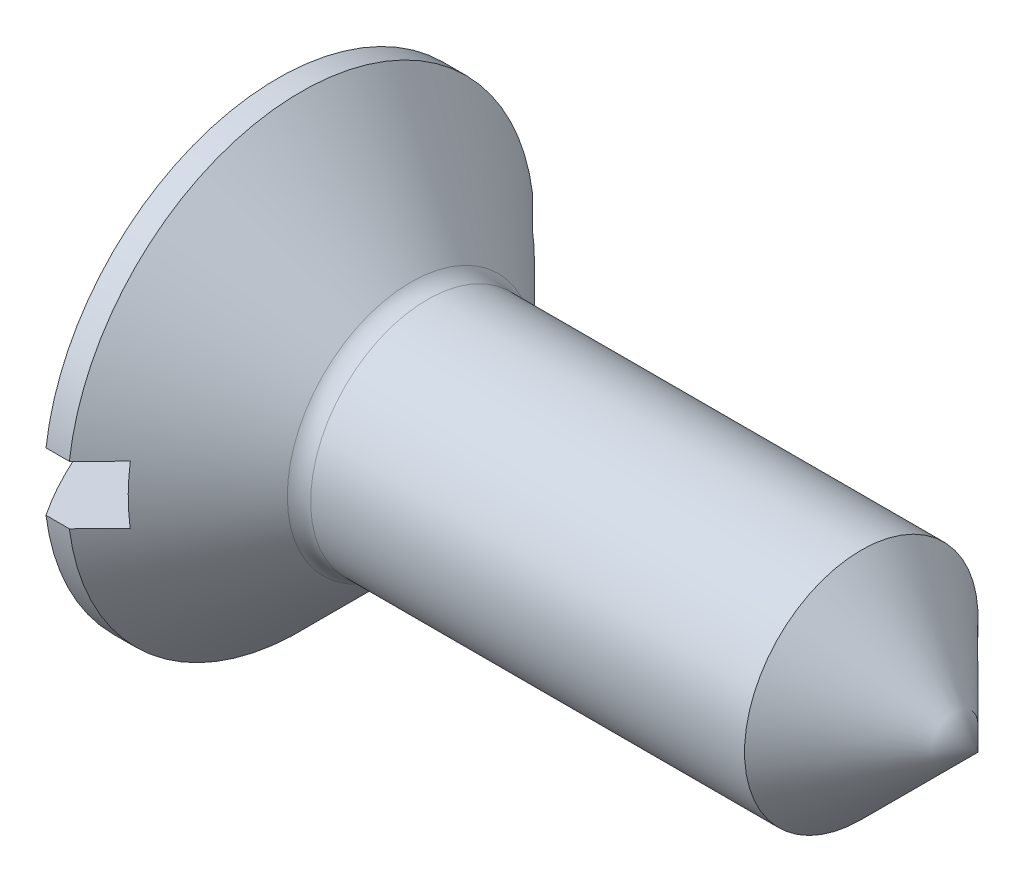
ISO-10303-21;
HEADER;
FILE_DESCRIPTION(('STEP AP214'),'2;1');
FILE_NAME('part.step','',(''),(''),'','','');
FILE_SCHEMA(('AUTOMOTIVE_DESIGN { 1 0 10303 214 1 1 1 1 }'));
ENDSEC;
DATA;
#1=APPLICATION_CONTEXT('core data for automotive mechanical design processes');
#2=APPLICATION_PROTOCOL_DEFINITION('international standard','automotive_design',2000,#1);
#3=PRODUCT_CONTEXT('',#1,'mechanical');
#4=PRODUCT('Part','Part','',(#3));
#5=PRODUCT_RELATED_PRODUCT_CATEGORY('part','',(#4));
#6=PRODUCT_DEFINITION_FORMATION('','',#4);
#7=PRODUCT_DEFINITION_CONTEXT('part definition',#1,'design');
#8=PRODUCT_DEFINITION('design','',#6,#7);
#9=PRODUCT_DEFINITION_SHAPE('','',#8);
#10=(LENGTH_UNIT() NAMED_UNIT(*) SI_UNIT(.MILLI.,.METRE.));
#11=(NAMED_UNIT(*) PLANE_ANGLE_UNIT() SI_UNIT($,.RADIAN.));
#12=(NAMED_UNIT(*) SI_UNIT($,.STERADIAN.) SOLID_ANGLE_UNIT());
#13=UNCERTAINTY_MEASURE_WITH_UNIT(LENGTH_MEASURE(1.E-05),#10,'distance_accuracy_value','');
#14=(GEOMETRIC_REPRESENTATION_CONTEXT(3) GLOBAL_UNCERTAINTY_ASSIGNED_CONTEXT((#13)) GLOBAL_UNIT_ASSIGNED_CONTEXT((#10,
#11,#12)) REPRESENTATION_CONTEXT('',''));
#15=CARTESIAN_POINT('',(0.,0.,0.));
#16=DIRECTION('',(0.,0.,1.));
#17=DIRECTION('',(1.,0.,0.));
#18=AXIS2_PLACEMENT_3D('',#15,#16,#17);
#19=CARTESIAN_POINT('',(5.99999999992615,0.,0.));
#20=DIRECTION('',(-1.,0.,0.));
#21=DIRECTION('',(0.,0.,1.));
#22=AXIS2_PLACEMENT_3D('',#19,#20,#21);
#23=CYLINDRICAL_SURFACE('',#22,1.);
#24=CARTESIAN_POINT('',(1.28284271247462,0.,0.));
#25=DIRECTION('',(1.,0.,0.));
#26=DIRECTION('',(0.,0.,-1.));
#27=AXIS2_PLACEMENT_3D('',#24,#25,#26);
#28=CIRCLE('',#27,1.);
#29=CARTESIAN_POINT('',(1.28284271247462,0.,-1.));
#30=VERTEX_POINT('',#29);
#31=EDGE_CURVE('E46',#30,#30,#28,.T.);
#32=ORIENTED_EDGE('',*,*,#31,.T.);
#33=EDGE_LOOP('',(#32));
#34=FACE_BOUND('',#33,.T.);
#35=CARTESIAN_POINT('',(4.99999999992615,0.,0.));
#36=DIRECTION('',(-1.,0.,0.));
#37=DIRECTION('',(0.,-1.,0.));
#38=AXIS2_PLACEMENT_3D('',#35,#36,#37);
#39=CIRCLE('',#38,1.);
#40=CARTESIAN_POINT('',(4.99999999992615,-1.,0.));
#41=VERTEX_POINT('',#40);
#42=EDGE_CURVE('E41',#41,#41,#39,.F.);
#43=ORIENTED_EDGE('',*,*,#42,.F.);
#44=EDGE_LOOP('',(#43));
#45=FACE_BOUND('',#44,.T.);
#46=ADVANCED_FACE('F37',(#34,#45),#23,.T.);
#47=CARTESIAN_POINT('',(5.99999999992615,0.,0.));
#48=DIRECTION('',(-1.,0.,0.));
#49=DIRECTION('',(0.,0.,1.));
#50=AXIS2_PLACEMENT_3D('',#47,#48,#49);
#51=CYLINDRICAL_SURFACE('',#50,2.);
#52=CARTESIAN_POINT('',(0.200000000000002,0.,0.));
#53=DIRECTION('',(-1.,0.,0.));
#54=DIRECTION('',(0.,0.,1.));
#55=AXIS2_PLACEMENT_3D('',#52,#53,#54);
#56=CIRCLE('',#55,2.);
#57=CARTESIAN_POINT('',(0.200000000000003,-0.250000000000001,-1.98431348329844));
#58=VERTEX_POINT('',#57);
#59=CARTESIAN_POINT('',(0.200000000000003,-0.250000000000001,1.98431348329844));
#60=VERTEX_POINT('',#59);
#61=EDGE_CURVE('E176',#58,#60,#56,.T.);
#62=ORIENTED_EDGE('',*,*,#61,.T.);
#63=DIRECTION('',(-1.,0.,0.));
#64=VECTOR('',#63,1.);
#65=CARTESIAN_POINT('',(5.99999999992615,-0.250000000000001,1.98431348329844));
#66=LINE('',#65,#64);
#67=CARTESIAN_POINT('',(0.,-0.25,1.98431348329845));
#68=VERTEX_POINT('',#67);
#69=EDGE_CURVE('E116',#60,#68,#66,.T.);
#70=ORIENTED_EDGE('',*,*,#69,.T.);
#71=CARTESIAN_POINT('',(0.,0.,0.));
#72=DIRECTION('',(1.,0.,0.));
#73=DIRECTION('',(0.,0.,-1.));
#74=AXIS2_PLACEMENT_3D('',#71,#72,#73);
#75=CIRCLE('',#74,2.);
#76=CARTESIAN_POINT('',(0.,-0.25,-1.98431348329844));
#77=VERTEX_POINT('',#76);
#78=EDGE_CURVE('E169',#68,#77,#75,.T.);
#79=ORIENTED_EDGE('',*,*,#78,.T.);
#80=DIRECTION('',(-1.,0.,0.));
#81=VECTOR('',#80,1.);
#82=CARTESIAN_POINT('',(5.99999999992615,-0.250000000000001,-1.98431348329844));
#83=LINE('',#82,#81);
#84=EDGE_CURVE('E107',#77,#58,#83,.F.);
#85=ORIENTED_EDGE('',*,*,#84,.T.);
#86=EDGE_LOOP('',(#62,#70,#79,#85));
#87=FACE_BOUND('',#86,.T.);
#88=ADVANCED_FACE('F211',(#87),#51,.T.);
#89=CARTESIAN_POINT('',(2.9910729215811,0.,0.));
#90=DIRECTION('',(1.,0.,0.));
#91=DIRECTION('',(0.,0.,-1.));
#92=AXIS2_PLACEMENT_3D('',#89,#90,#91);
#93=DEGENERATE_TOROIDAL_SURFACE('',#92,0.00336785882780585,3.6,.F.);
#94=CARTESIAN_POINT('',(-0.600000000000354,0.25,0.));
#95=CARTESIAN_POINT('',(-0.60000171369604,0.25,-0.0835139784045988));
#96=CARTESIAN_POINT('',(-0.597046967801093,0.25,-0.1669986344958));
#97=CARTESIAN_POINT('',(-0.579278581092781,0.25,-0.41879974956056));
#98=CARTESIAN_POINT('',(-0.555429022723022,0.25,-0.586581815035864));
#99=CARTESIAN_POINT('',(-0.484314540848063,0.25,-0.917304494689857));
#100=CARTESIAN_POINT('',(-0.437012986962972,0.25,-1.08023711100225));
#101=CARTESIAN_POINT('',(-0.319957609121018,0.25,-1.39770760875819));
#102=CARTESIAN_POINT('',(-0.250221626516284,0.25,-1.55225204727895));
#103=CARTESIAN_POINT('',(-0.0897069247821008,0.25,-1.84995386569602));
#104=CARTESIAN_POINT('',(0.00107093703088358,0.25,-1.99311170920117));
#105=CARTESIAN_POINT('',(0.221364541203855,0.25,-2.29158568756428));
#106=CARTESIAN_POINT('',(0.354976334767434,0.25,-2.44390384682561));
#107=CARTESIAN_POINT('',(0.645926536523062,0.25,-2.7239998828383));
#108=CARTESIAN_POINT('',(0.803277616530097,0.25,-2.85176456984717));
#109=CARTESIAN_POINT('',(1.13717566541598,0.25,-3.0790444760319));
#110=CARTESIAN_POINT('',(1.31371920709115,0.25,-3.17856472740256));
#111=CARTESIAN_POINT('',(1.68098807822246,0.25,-3.34654103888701));
#112=CARTESIAN_POINT('',(1.87171190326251,0.25,-3.41500038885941));
#113=CARTESIAN_POINT('',(2.26195625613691,0.250000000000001,-3.5189330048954));
#114=CARTESIAN_POINT('',(2.46147724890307,0.250000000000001,-3.55440452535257));
#115=CARTESIAN_POINT('',(2.86364520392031,0.250000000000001,-3.59134777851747));
#116=CARTESIAN_POINT('',(3.06629221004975,0.250000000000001,-3.59281903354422));
#117=CARTESIAN_POINT('',(3.46895540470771,0.250000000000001,-3.56171911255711));
#118=CARTESIAN_POINT('',(3.66897161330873,0.250000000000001,-3.52914819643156));
#119=CARTESIAN_POINT('',(4.06069778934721,0.250000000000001,-3.43088863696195));
#120=CARTESIAN_POINT('',(4.25240772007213,0.250000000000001,-3.36519984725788));
#121=CARTESIAN_POINT('',(4.62207918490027,0.250000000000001,-3.2025687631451));
#122=CARTESIAN_POINT('',(4.8000406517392,0.250000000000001,-3.10562631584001));
#123=CARTESIAN_POINT('',(5.13715973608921,0.250000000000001,-2.88324159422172));
#124=CARTESIAN_POINT('',(5.29631763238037,0.250000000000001,-2.75779974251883));
#125=CARTESIAN_POINT('',(5.59131262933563,0.250000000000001,-2.48197785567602));
#126=CARTESIAN_POINT('',(5.72715002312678,0.250000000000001,-2.33159813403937));
#127=CARTESIAN_POINT('',(5.9716548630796,0.250000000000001,-2.01016276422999));
#128=CARTESIAN_POINT('',(6.08032137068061,0.250000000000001,-1.83910640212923));
#129=CARTESIAN_POINT('',(6.26739113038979,0.250000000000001,-1.48117708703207));
#130=CARTESIAN_POINT('',(6.34579453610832,0.250000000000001,-1.29430421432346));
#131=CARTESIAN_POINT('',(6.47011192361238,0.250000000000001,-0.910059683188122));
#132=CARTESIAN_POINT('',(6.51602737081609,0.250000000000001,-0.712688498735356));
#133=CARTESIAN_POINT('',(6.57403700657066,0.250000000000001,-0.313019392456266));
#134=CARTESIAN_POINT('',(6.58613111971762,0.250000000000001,-0.110721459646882));
#135=CARTESIAN_POINT('',(6.57581716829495,0.250000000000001,0.292990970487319));
#136=CARTESIAN_POINT('',(6.55340897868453,0.250000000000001,0.494405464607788));
#137=CARTESIAN_POINT('',(6.47535216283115,0.250000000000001,0.889554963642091));
#138=CARTESIAN_POINT('',(6.41988069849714,0.250000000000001,1.08332507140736));
#139=CARTESIAN_POINT('',(6.2773401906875,0.250000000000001,1.45888232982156));
#140=CARTESIAN_POINT('',(6.19027067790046,0.250000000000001,1.64066930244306));
#141=CARTESIAN_POINT('',(5.98646763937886,0.250000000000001,1.98805412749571));
#142=CARTESIAN_POINT('',(5.86958206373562,0.250000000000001,2.15356278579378));
#143=CARTESIAN_POINT('',(5.60968631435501,0.250000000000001,2.46260968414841));
#144=CARTESIAN_POINT('',(5.46667616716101,0.250000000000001,2.6061479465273));
#145=CARTESIAN_POINT('',(5.1585701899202,0.250000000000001,2.86719941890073));
#146=CARTESIAN_POINT('',(4.99347143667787,0.250000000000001,2.98470917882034));
#147=CARTESIAN_POINT('',(4.64588840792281,0.250000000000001,3.19034396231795));
#148=CARTESIAN_POINT('',(4.46340404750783,0.250000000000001,3.27846884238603));
#149=CARTESIAN_POINT('',(4.08622872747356,0.250000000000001,3.42283240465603));
#150=CARTESIAN_POINT('',(3.89153764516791,0.250000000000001,3.47907076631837));
#151=CARTESIAN_POINT('',(3.49547757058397,0.250000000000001,3.55806340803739));
#152=CARTESIAN_POINT('',(3.29410858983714,0.250000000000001,3.58081774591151));
#153=CARTESIAN_POINT('',(2.8904080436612,0.250000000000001,3.5921966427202));
#154=CARTESIAN_POINT('',(2.68807647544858,0.250000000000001,3.58082110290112));
#155=CARTESIAN_POINT('',(2.28819470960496,0.250000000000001,3.52426288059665));
#156=CARTESIAN_POINT('',(2.09064451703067,0.250000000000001,3.47908016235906));
#157=CARTESIAN_POINT('',(1.70593262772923,0.25,3.35618992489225));
#158=CARTESIAN_POINT('',(1.51877098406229,0.25,3.27848223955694));
#159=CARTESIAN_POINT('',(1.16015223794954,0.25,3.09274852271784));
#160=CARTESIAN_POINT('',(0.988694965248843,0.25,2.98472281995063));
#161=CARTESIAN_POINT('',(0.666355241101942,0.25,2.74142466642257));
#162=CARTESIAN_POINT('',(0.515472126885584,0.25,2.60615309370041));
#163=CARTESIAN_POINT('',(0.238546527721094,0.25,2.31218424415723));
#164=CARTESIAN_POINT('',(0.112505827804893,0.25,2.15348528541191));
#165=CARTESIAN_POINT('',(-0.111155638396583,0.25,1.81717273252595));
#166=CARTESIAN_POINT('',(-0.208772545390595,0.25,1.63955657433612));
#167=CARTESIAN_POINT('',(-0.37276990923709,0.25,1.27045615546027));
#168=CARTESIAN_POINT('',(-0.439161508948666,0.25,1.07897687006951));
#169=CARTESIAN_POINT('',(-0.525778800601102,0.25,0.739073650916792));
#170=CARTESIAN_POINT('',(-0.553542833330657,0.25,0.592514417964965));
#171=CARTESIAN_POINT('',(-0.59063503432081,0.25,0.29726958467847));
#172=CARTESIAN_POINT('',(-0.599996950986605,0.25,0.148588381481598));
#173=CARTESIAN_POINT('',(-0.600000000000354,0.25,0.));
#174=B_SPLINE_CURVE_WITH_KNOTS('',3,(#94,#95,#96,#97,#98,#99,#100,#101,#102,#103,#104,#105,#106,
#107,#108,#109,#110,#111,#112,#113,#114,#115,#116,#117,#118,#119,#120,#121,#122,#123,#124,#125,
#126,#127,#128,#129,#130,#131,#132,#133,#134,#135,#136,#137,#138,#139,#140,#141,#142,#143,#144,
#145,#146,#147,#148,#149,#150,#151,#152,#153,#154,#155,#156,#157,#158,#159,#160,#161,#162,#163,
#164,#165,#166,#167,#168,#169,#170,#171,#172,#173),.UNSPECIFIED.,.T.,.F.,(4,2,2,2,2,2,2,2,2,2,2,
2,2,2,2,2,2,2,2,2,2,2,2,2,2,2,2,2,2,2,2,2,2,2,2,2,2,2,2,4),(0.,0.25046611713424,
0.757008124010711,1.26434381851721,1.77127703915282,2.27818960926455,2.88307777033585,
3.48828996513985,4.09339426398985,4.69843445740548,5.30350666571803,5.90858737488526,
6.5136634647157,7.11874222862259,7.72382395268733,8.32889670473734,8.93396185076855,
9.5390478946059,10.1441308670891,10.7491865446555,11.3542435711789,11.9593027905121,
12.5611487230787,13.1630035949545,13.7679912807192,14.3729783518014,14.9780455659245,
15.5831157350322,16.1881919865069,16.7932671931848,17.3983441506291,18.003421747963,
18.6085024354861,19.2135765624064,19.8186311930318,20.4237292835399,21.0289094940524,
21.6338735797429,22.080323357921,22.5259536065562),.UNSPECIFIED.);
#175=CARTESIAN_POINT('',(0.,0.25,1.98431348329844));
#176=VERTEX_POINT('',#175);
#177=CARTESIAN_POINT('',(0.,0.25,-1.98431348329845));
#178=VERTEX_POINT('',#177);
#179=EDGE_CURVE('E153',#176,#178,#174,.T.);
#180=ORIENTED_EDGE('',*,*,#179,.F.);
#181=EDGE_CURVE('E172',#178,#176,#75,.T.);
#182=ORIENTED_EDGE('',*,*,#181,.F.);
#183=EDGE_LOOP('',(#180,#182));
#184=FACE_BOUND('',#183,.T.);
#185=ADVANCED_FACE('F142',(#184),#93,.F.);
#186=CARTESIAN_POINT('',(1.2,0.,0.));
#187=DIRECTION('',(-1.,0.,0.));
#188=DIRECTION('',(0.,0.,1.));
#189=AXIS2_PLACEMENT_3D('',#186,#187,#188);
#190=CONICAL_SURFACE('',#189,1.,0.78539816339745);
#191=CARTESIAN_POINT('',(1.14142135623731,0.,0.));
#192=DIRECTION('',(1.,0.,0.));
#193=DIRECTION('',(0.,0.,-1.));
#194=AXIS2_PLACEMENT_3D('',#191,#192,#193);
#195=CIRCLE('',#194,1.05857864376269);
#196=CARTESIAN_POINT('',(1.14142135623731,0.,-1.05857864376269));
#197=VERTEX_POINT('',#196);
#198=EDGE_CURVE('E11',#197,#197,#195,.F.);
#199=ORIENTED_EDGE('',*,*,#198,.T.);
#200=EDGE_LOOP('',(#199));
#201=FACE_BOUND('',#200,.T.);
#202=CARTESIAN_POINT('',(-2.20526465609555,0.25,-4.39816515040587));
#203=CARTESIAN_POINT('',(-2.05588275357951,0.25,-4.24854021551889));
#204=CARTESIAN_POINT('',(-1.90651135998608,0.25,-4.0989047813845));
#205=CARTESIAN_POINT('',(-1.60780129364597,0.25,-3.79959791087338));
#206=CARTESIAN_POINT('',(-1.45846262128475,0.25,-3.64992647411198));
#207=CARTESIAN_POINT('',(-1.15979531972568,0.25,-3.35049812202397));
#208=CARTESIAN_POINT('',(-1.0104667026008,0.25,-3.20074119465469));
#209=CARTESIAN_POINT('',(-0.711882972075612,0.25,-2.90115732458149));
#210=CARTESIAN_POINT('',(-0.562627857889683,0.25,-2.75133038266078));
#211=CARTESIAN_POINT('',(-0.259171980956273,0.25,-2.44647624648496));
#212=CARTESIAN_POINT('',(-0.104975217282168,0.25,-2.29144507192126));
#213=CARTESIAN_POINT('',(0.203208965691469,0.25,-1.9811645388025));
#214=CARTESIAN_POINT('',(0.357196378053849,0.25,-1.82591517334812));
#215=CARTESIAN_POINT('',(0.587822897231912,0.25,-1.59271539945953));
#216=CARTESIAN_POINT('',(0.664633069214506,0.25,-1.51493419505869));
#217=CARTESIAN_POINT('',(0.818073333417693,0.25,-1.35919209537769));
#218=CARTESIAN_POINT('',(0.894703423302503,0.25,-1.28123119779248));
#219=CARTESIAN_POINT('',(1.04765221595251,0.25,-1.12501396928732));
#220=CARTESIAN_POINT('',(1.12397093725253,0.25,-1.04675765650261));
#221=CARTESIAN_POINT('',(1.27605378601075,0.25,-0.889708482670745));
#222=CARTESIAN_POINT('',(1.35181792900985,0.25,-0.81091563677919));
#223=CARTESIAN_POINT('',(1.44715667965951,0.25,-0.710153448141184));
#224=CARTESIAN_POINT('',(1.46732397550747,0.25,-0.688746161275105));
#225=CARTESIAN_POINT('',(1.50752968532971,0.25,-0.645810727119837));
#226=CARTESIAN_POINT('',(1.52756809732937,0.25,-0.624282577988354));
#227=CARTESIAN_POINT('',(1.58730758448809,0.25,-0.55961798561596));
#228=CARTESIAN_POINT('',(1.62676988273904,0.25,-0.516257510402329));
#229=CARTESIAN_POINT('',(1.69158194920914,0.25,-0.442915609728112));
#230=CARTESIAN_POINT('',(1.7172861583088,0.25,-0.413247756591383));
#231=CARTESIAN_POINT('',(1.76786123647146,0.25,-0.352882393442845));
#232=CARTESIAN_POINT('',(1.79272608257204,0.25,-0.322179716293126));
#233=CARTESIAN_POINT('',(1.82866649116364,0.25,-0.274761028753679));
#234=CARTESIAN_POINT('',(1.84049252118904,0.25,-0.25861833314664));
#235=CARTESIAN_POINT('',(1.86334485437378,0.25,-0.225780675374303));
#236=CARTESIAN_POINT('',(1.87437155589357,0.25,-0.209085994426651));
#237=CARTESIAN_POINT('',(1.89510087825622,0.25,-0.175055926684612));
#238=CARTESIAN_POINT('',(1.90481312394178,0.25,-0.157726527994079));
#239=CARTESIAN_POINT('',(1.92220985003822,0.25,-0.122099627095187));
#240=CARTESIAN_POINT('',(1.92990049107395,0.250000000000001,-0.103805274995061));
#241=CARTESIAN_POINT('',(1.94148779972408,0.250000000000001,-0.0677562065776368));
#242=CARTESIAN_POINT('',(1.94565854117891,0.250000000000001,-0.0500954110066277));
#243=CARTESIAN_POINT('',(1.95020412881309,0.250000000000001,-0.0143600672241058));
#244=CARTESIAN_POINT('',(1.9506024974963,0.250000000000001,0.00371121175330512));
#245=CARTESIAN_POINT('',(1.94753973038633,0.250000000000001,0.0394304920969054));
#246=CARTESIAN_POINT('',(1.94409159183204,0.250000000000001,0.057079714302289));
#247=CARTESIAN_POINT('',(1.93426190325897,0.250000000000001,0.0916318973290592));
#248=CARTESIAN_POINT('',(1.92785728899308,0.250000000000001,0.108527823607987));
#249=CARTESIAN_POINT('',(1.9141890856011,0.250000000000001,0.139094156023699));
#250=CARTESIAN_POINT('',(1.90717656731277,0.25,0.152881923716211));
#251=CARTESIAN_POINT('',(1.89218766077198,0.25,0.179929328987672));
#252=CARTESIAN_POINT('',(1.88421052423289,0.25,0.193188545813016));
#253=CARTESIAN_POINT('',(1.85925152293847,0.25,0.232428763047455));
#254=CARTESIAN_POINT('',(1.84128955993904,0.25,0.25777816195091));
#255=CARTESIAN_POINT('',(1.80388647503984,0.25,0.307694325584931));
#256=CARTESIAN_POINT('',(1.78443313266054,0.25,0.33225159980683));
#257=CARTESIAN_POINT('',(1.74478880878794,0.25,0.380668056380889));
#258=CARTESIAN_POINT('',(1.72459960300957,0.25,0.404528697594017));
#259=CARTESIAN_POINT('',(1.66418602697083,0.25,0.474501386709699));
#260=CARTESIAN_POINT('',(1.62329550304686,0.25,0.520033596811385));
#261=CARTESIAN_POINT('',(1.5406832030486,0.25,0.610341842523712));
#262=CARTESIAN_POINT('',(1.49896127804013,0.25,0.65511773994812));
#263=CARTESIAN_POINT('',(1.41499813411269,0.25,0.744280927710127));
#264=CARTESIAN_POINT('',(1.37275635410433,0.25,0.788667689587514));
#265=CARTESIAN_POINT('',(1.28799192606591,0.25,0.877164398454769));
#266=CARTESIAN_POINT('',(1.24546930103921,0.25,0.921274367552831));
#267=CARTESIAN_POINT('',(1.11848668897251,0.25,1.05245331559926));
#268=CARTESIAN_POINT('',(1.03376105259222,0.25,1.1392649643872));
#269=CARTESIAN_POINT('',(0.86400413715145,0.25,1.31250563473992));
#270=CARTESIAN_POINT('',(0.778973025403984,0.25,1.39893482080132));
#271=CARTESIAN_POINT('',(0.574754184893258,0.25,1.60603012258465));
#272=CARTESIAN_POINT('',(0.455470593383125,0.25,1.72660170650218));
#273=CARTESIAN_POINT('',(0.216700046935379,0.25,1.96754389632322));
#274=CARTESIAN_POINT('',(0.0972130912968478,0.25,2.08791450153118));
#275=CARTESIAN_POINT('',(-0.26147589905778,0.25,2.44890132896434));
#276=CARTESIAN_POINT('',(-0.500855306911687,0.25,2.68934128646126));
#277=CARTESIAN_POINT('',(-0.984368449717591,0.25,3.17460431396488));
#278=CARTESIAN_POINT('',(-1.22850591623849,0.25,3.41942366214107));
#279=CARTESIAN_POINT('',(-1.7168446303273,0.25,3.90888955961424));
#280=CARTESIAN_POINT('',(-1.96104585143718,0.25,4.15353613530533));
#281=CARTESIAN_POINT('',(-2.20526465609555,0.25,4.39816515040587));
#282=B_SPLINE_CURVE_WITH_KNOTS('',3,(#202,#203,#204,#205,#206,#207,#208,#209,#210,#211,#212,
#213,#214,#215,#216,#217,#218,#219,#220,#221,#222,#223,#224,#225,#226,#227,#228,#229,#230,#231,
#232,#233,#234,#235,#236,#237,#238,#239,#240,#241,#242,#243,#244,#245,#246,#247,#248,#249,#250,
#251,#252,#253,#254,#255,#256,#257,#258,#259,#260,#261,#262,#263,#264,#265,#266,#267,#268,#269,
#270,#271,#272,#273,#274,#275,#276,#277,#278,#279,#280,#281),.UNSPECIFIED.,.F.,.F.,(4,2,2,2,2,2,
2,2,2,2,2,2,2,2,2,2,2,2,2,2,2,2,2,2,2,2,2,2,2,2,2,2,2,2,2,2,2,2,2,4),(0.,0.634289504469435,
1.26858611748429,1.90304300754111,2.53749296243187,3.19346683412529,3.84946193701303,
4.17740613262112,4.50535455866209,4.83328316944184,5.16120255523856,5.24943414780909,
5.33766708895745,5.51353700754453,5.63129259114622,5.74976475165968,5.80978298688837,
5.86977110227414,5.92929298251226,5.9886313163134,6.04275369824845,6.09653837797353,
6.15014186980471,6.20417079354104,6.25052854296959,6.29692248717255,6.39002498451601,
6.48399478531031,6.5777511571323,6.76131913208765,6.94492029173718,7.12874090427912,
7.31254664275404,7.67645641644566,8.0401904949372,8.54900684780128,9.05782495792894,
10.0756776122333,11.1129126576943,12.1499158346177),.UNSPECIFIED.);
#283=CARTESIAN_POINT('',(0.460000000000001,0.25,1.72194657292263));
#284=VERTEX_POINT('',#283);
#285=CARTESIAN_POINT('',(0.200000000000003,0.250000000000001,1.98431348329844));
#286=VERTEX_POINT('',#285);
#287=EDGE_CURVE('E146',#284,#286,#282,.T.);
#288=ORIENTED_EDGE('',*,*,#287,.F.);
#289=CARTESIAN_POINT('',(0.460000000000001,0.,0.));
#290=DIRECTION('',(1.,0.,0.));
#291=DIRECTION('',(0.,0.,-1.));
#292=AXIS2_PLACEMENT_3D('',#289,#290,#291);
#293=CIRCLE('',#292,1.74);
#294=CARTESIAN_POINT('',(0.460000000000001,-0.25,1.72194657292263));
#295=VERTEX_POINT('',#294);
#296=EDGE_CURVE('E183',#295,#284,#293,.F.);
#297=ORIENTED_EDGE('',*,*,#296,.F.);
#298=CARTESIAN_POINT('',(-2.20526465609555,-0.25,4.39816515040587));
#299=CARTESIAN_POINT('',(-2.05588275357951,-0.25,4.24854021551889));
#300=CARTESIAN_POINT('',(-1.90651135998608,-0.25,4.09890478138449));
#301=CARTESIAN_POINT('',(-1.60780129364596,-0.25,3.79959791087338));
#302=CARTESIAN_POINT('',(-1.45846262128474,-0.25,3.64992647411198));
#303=CARTESIAN_POINT('',(-1.15979531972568,-0.25,3.35049812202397));
#304=CARTESIAN_POINT('',(-1.0104667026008,-0.25,3.20074119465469));
#305=CARTESIAN_POINT('',(-0.711882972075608,-0.25,2.90115732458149));
#306=CARTESIAN_POINT('',(-0.562627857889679,-0.25,2.75133038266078));
#307=CARTESIAN_POINT('',(-0.259171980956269,-0.25,2.44647624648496));
#308=CARTESIAN_POINT('',(-0.104975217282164,-0.25,2.29144507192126));
#309=CARTESIAN_POINT('',(0.203208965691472,-0.25,1.98116453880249));
#310=CARTESIAN_POINT('',(0.357196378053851,-0.25,1.82591517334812));
#311=CARTESIAN_POINT('',(0.587822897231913,-0.25,1.59271539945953));
#312=CARTESIAN_POINT('',(0.664633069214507,-0.25,1.51493419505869));
#313=CARTESIAN_POINT('',(0.818073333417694,-0.25,1.35919209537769));
#314=CARTESIAN_POINT('',(0.894703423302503,-0.25,1.28123119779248));
#315=CARTESIAN_POINT('',(1.04765221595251,-0.25,1.12501396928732));
#316=CARTESIAN_POINT('',(1.12397093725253,-0.25,1.04675765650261));
#317=CARTESIAN_POINT('',(1.27605378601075,-0.25,0.889708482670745));
#318=CARTESIAN_POINT('',(1.35181792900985,-0.25,0.81091563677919));
#319=CARTESIAN_POINT('',(1.44715667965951,-0.25,0.710153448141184));
#320=CARTESIAN_POINT('',(1.46732397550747,-0.25,0.688746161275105));
#321=CARTESIAN_POINT('',(1.50752968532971,-0.25,0.645810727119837));
#322=CARTESIAN_POINT('',(1.52756809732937,-0.25,0.624282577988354));
#323=CARTESIAN_POINT('',(1.58730758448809,-0.25,0.55961798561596));
#324=CARTESIAN_POINT('',(1.62676988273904,-0.25,0.516257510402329));
#325=CARTESIAN_POINT('',(1.69158194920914,-0.25,0.442915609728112));
#326=CARTESIAN_POINT('',(1.7172861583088,-0.25,0.413247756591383));
#327=CARTESIAN_POINT('',(1.76786123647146,-0.25,0.352882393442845));
#328=CARTESIAN_POINT('',(1.79272608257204,-0.25,0.322179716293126));
#329=CARTESIAN_POINT('',(1.82866649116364,-0.25,0.274761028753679));
#330=CARTESIAN_POINT('',(1.84049252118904,-0.25,0.258618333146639));
#331=CARTESIAN_POINT('',(1.86334485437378,-0.25,0.225780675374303));
#332=CARTESIAN_POINT('',(1.87437155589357,-0.25,0.209085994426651));
#333=CARTESIAN_POINT('',(1.89510087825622,-0.25,0.175055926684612));
#334=CARTESIAN_POINT('',(1.90481312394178,-0.25,0.157726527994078));
#335=CARTESIAN_POINT('',(1.92220985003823,-0.25,0.122099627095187));
#336=CARTESIAN_POINT('',(1.92990049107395,-0.250000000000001,0.10380527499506));
#337=CARTESIAN_POINT('',(1.94148779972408,-0.250000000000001,0.0677562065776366));
#338=CARTESIAN_POINT('',(1.94565854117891,-0.250000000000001,0.0500954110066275));
#339=CARTESIAN_POINT('',(1.95020412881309,-0.250000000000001,0.0143600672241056));
#340=CARTESIAN_POINT('',(1.9506024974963,-0.250000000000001,-0.00371121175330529));
#341=CARTESIAN_POINT('',(1.94753973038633,-0.250000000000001,-0.0394304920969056));
#342=CARTESIAN_POINT('',(1.94409159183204,-0.250000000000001,-0.0570797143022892));
#343=CARTESIAN_POINT('',(1.93426190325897,-0.250000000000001,-0.0916318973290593));
#344=CARTESIAN_POINT('',(1.92785728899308,-0.250000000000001,-0.108527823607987));
#345=CARTESIAN_POINT('',(1.9141890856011,-0.250000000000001,-0.139094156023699));
#346=CARTESIAN_POINT('',(1.90717656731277,-0.25,-0.152881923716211));
#347=CARTESIAN_POINT('',(1.89218766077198,-0.25,-0.179929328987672));
#348=CARTESIAN_POINT('',(1.88421052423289,-0.25,-0.193188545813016));
#349=CARTESIAN_POINT('',(1.85925152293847,-0.25,-0.232428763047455));
#350=CARTESIAN_POINT('',(1.84128955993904,-0.25,-0.25777816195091));
#351=CARTESIAN_POINT('',(1.80388647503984,-0.25,-0.307694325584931));
#352=CARTESIAN_POINT('',(1.78443313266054,-0.25,-0.33225159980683));
#353=CARTESIAN_POINT('',(1.74478880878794,-0.25,-0.380668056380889));
#354=CARTESIAN_POINT('',(1.72459960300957,-0.25,-0.404528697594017));
#355=CARTESIAN_POINT('',(1.66418602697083,-0.25,-0.474501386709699));
#356=CARTESIAN_POINT('',(1.62329550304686,-0.25,-0.520033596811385));
#357=CARTESIAN_POINT('',(1.5406832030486,-0.25,-0.610341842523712));
#358=CARTESIAN_POINT('',(1.49896127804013,-0.25,-0.65511773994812));
#359=CARTESIAN_POINT('',(1.41499813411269,-0.25,-0.744280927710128));
#360=CARTESIAN_POINT('',(1.37275635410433,-0.25,-0.788667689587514));
#361=CARTESIAN_POINT('',(1.28799192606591,-0.25,-0.87716439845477));
#362=CARTESIAN_POINT('',(1.24546930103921,-0.25,-0.921274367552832));
#363=CARTESIAN_POINT('',(1.11848668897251,-0.25,-1.05245331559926));
#364=CARTESIAN_POINT('',(1.03376105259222,-0.25,-1.1392649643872));
#365=CARTESIAN_POINT('',(0.86400413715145,-0.25,-1.31250563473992));
#366=CARTESIAN_POINT('',(0.778973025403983,-0.25,-1.39893482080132));
#367=CARTESIAN_POINT('',(0.574754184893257,-0.25,-1.60603012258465));
#368=CARTESIAN_POINT('',(0.455470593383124,-0.25,-1.72660170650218));
#369=CARTESIAN_POINT('',(0.216700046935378,-0.25,-1.96754389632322));
#370=CARTESIAN_POINT('',(0.097213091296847,-0.25,-2.08791450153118));
#371=CARTESIAN_POINT('',(-0.261475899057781,-0.25,-2.44890132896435));
#372=CARTESIAN_POINT('',(-0.500855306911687,-0.25,-2.68934128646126));
#373=CARTESIAN_POINT('',(-0.98436844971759,-0.25,-3.17460431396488));
#374=CARTESIAN_POINT('',(-1.22850591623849,-0.25,-3.41942366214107));
#375=CARTESIAN_POINT('',(-1.7168446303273,-0.25,-3.90888955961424));
#376=CARTESIAN_POINT('',(-1.96104585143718,-0.25,-4.15353613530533));
#377=CARTESIAN_POINT('',(-2.20526465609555,-0.25,-4.39816515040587));
#378=B_SPLINE_CURVE_WITH_KNOTS('',3,(#298,#299,#300,#301,#302,#303,#304,#305,#306,#307,#308,
#309,#310,#311,#312,#313,#314,#315,#316,#317,#318,#319,#320,#321,#322,#323,#324,#325,#326,#327,
#328,#329,#330,#331,#332,#333,#334,#335,#336,#337,#338,#339,#340,#341,#342,#343,#344,#345,#346,
#347,#348,#349,#350,#351,#352,#353,#354,#355,#356,#357,#358,#359,#360,#361,#362,#363,#364,#365,
#366,#367,#368,#369,#370,#371,#372,#373,#374,#375,#376,#377),.UNSPECIFIED.,.F.,.F.,(4,2,2,2,2,2,
2,2,2,2,2,2,2,2,2,2,2,2,2,2,2,2,2,2,2,2,2,2,2,2,2,2,2,2,2,2,2,2,2,4),(0.,0.634289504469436,
1.26858611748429,1.90304300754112,2.53749296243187,3.1934668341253,3.84946193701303,
4.17740613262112,4.50535455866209,4.83328316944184,5.16120255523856,5.24943414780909,
5.33766708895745,5.51353700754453,5.63129259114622,5.74976475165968,5.80978298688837,
5.86977110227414,5.92929298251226,5.9886313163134,6.04275369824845,6.09653837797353,
6.15014186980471,6.20417079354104,6.25052854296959,6.29692248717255,6.39002498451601,
6.48399478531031,6.5777511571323,6.76131913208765,6.94492029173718,7.12874090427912,
7.31254664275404,7.67645641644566,8.0401904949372,8.54900684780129,9.05782495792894,
10.0756776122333,11.1129126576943,12.1499158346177),.UNSPECIFIED.);
#379=EDGE_CURVE('E135',#60,#295,#378,.T.);
#380=ORIENTED_EDGE('',*,*,#379,.F.);
#381=ORIENTED_EDGE('',*,*,#61,.F.);
#382=CARTESIAN_POINT('',(0.460000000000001,-0.25,-1.72194657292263));
#383=VERTEX_POINT('',#382);
#384=EDGE_CURVE('E117',#383,#58,#378,.T.);
#385=ORIENTED_EDGE('',*,*,#384,.F.);
#386=CARTESIAN_POINT('',(0.460000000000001,0.25,-1.72194657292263));
#387=VERTEX_POINT('',#386);
#388=EDGE_CURVE('E181',#387,#383,#293,.F.);
#389=ORIENTED_EDGE('',*,*,#388,.F.);
#390=CARTESIAN_POINT('',(0.200000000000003,0.250000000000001,-1.98431348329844));
#391=VERTEX_POINT('',#390);
#392=EDGE_CURVE('E155',#391,#387,#282,.T.);
#393=ORIENTED_EDGE('',*,*,#392,.F.);
#394=EDGE_CURVE('E180',#286,#391,#56,.T.);
#395=ORIENTED_EDGE('',*,*,#394,.F.);
#396=EDGE_LOOP('',(#288,#297,#380,#381,#385,#389,#393,#395));
#397=FACE_BOUND('',#396,.T.);
#398=ADVANCED_FACE('F137',(#201,#397),#190,.T.);
#399=ORIENTED_EDGE('',*,*,#394,.T.);
#400=DIRECTION('',(-1.,0.,0.));
#401=VECTOR('',#400,1.);
#402=CARTESIAN_POINT('',(5.99999999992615,0.250000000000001,-1.98431348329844));
#403=LINE('',#402,#401);
#404=EDGE_CURVE('E60',#391,#178,#403,.T.);
#405=ORIENTED_EDGE('',*,*,#404,.T.);
#406=ORIENTED_EDGE('',*,*,#181,.T.);
#407=DIRECTION('',(-1.,0.,0.));
#408=VECTOR('',#407,1.);
#409=CARTESIAN_POINT('',(5.99999999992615,0.250000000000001,1.98431348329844));
#410=LINE('',#409,#408);
#411=EDGE_CURVE('E154',#176,#286,#410,.F.);
#412=ORIENTED_EDGE('',*,*,#411,.T.);
#413=EDGE_LOOP('',(#399,#405,#406,#412));
#414=FACE_BOUND('',#413,.T.);
#415=ADVANCED_FACE('F141',(#414),#51,.T.);
#416=CARTESIAN_POINT('',(-0.600000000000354,-0.25,0.));
#417=CARTESIAN_POINT('',(-0.60000171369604,-0.25,0.0835139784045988));
#418=CARTESIAN_POINT('',(-0.597046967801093,-0.25,0.1669986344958));
#419=CARTESIAN_POINT('',(-0.579278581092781,-0.25,0.41879974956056));
#420=CARTESIAN_POINT('',(-0.555429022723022,-0.25,0.586581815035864));
#421=CARTESIAN_POINT('',(-0.484314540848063,-0.25,0.917304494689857));
#422=CARTESIAN_POINT('',(-0.437012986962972,-0.25,1.08023711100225));
#423=CARTESIAN_POINT('',(-0.319957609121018,-0.25,1.39770760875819));
#424=CARTESIAN_POINT('',(-0.250221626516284,-0.25,1.55225204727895));
#425=CARTESIAN_POINT('',(-0.0897069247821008,-0.25,1.84995386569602));
#426=CARTESIAN_POINT('',(0.00107093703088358,-0.25,1.99311170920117));
#427=CARTESIAN_POINT('',(0.221364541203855,-0.25,2.29158568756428));
#428=CARTESIAN_POINT('',(0.354976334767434,-0.25,2.44390384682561));
#429=CARTESIAN_POINT('',(0.645926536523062,-0.25,2.7239998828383));
#430=CARTESIAN_POINT('',(0.803277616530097,-0.25,2.85176456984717));
#431=CARTESIAN_POINT('',(1.13717566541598,-0.25,3.0790444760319));
#432=CARTESIAN_POINT('',(1.31371920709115,-0.25,3.17856472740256));
#433=CARTESIAN_POINT('',(1.68098807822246,-0.25,3.34654103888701));
#434=CARTESIAN_POINT('',(1.87171190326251,-0.25,3.41500038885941));
#435=CARTESIAN_POINT('',(2.26195625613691,-0.250000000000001,3.5189330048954));
#436=CARTESIAN_POINT('',(2.46147724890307,-0.250000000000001,3.55440452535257));
#437=CARTESIAN_POINT('',(2.86364520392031,-0.250000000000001,3.59134777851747));
#438=CARTESIAN_POINT('',(3.06629221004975,-0.250000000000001,3.59281903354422));
#439=CARTESIAN_POINT('',(3.46895540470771,-0.250000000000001,3.56171911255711));
#440=CARTESIAN_POINT('',(3.66897161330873,-0.250000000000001,3.52914819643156));
#441=CARTESIAN_POINT('',(4.06069778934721,-0.250000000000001,3.43088863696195));
#442=CARTESIAN_POINT('',(4.25240772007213,-0.250000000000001,3.36519984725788));
#443=CARTESIAN_POINT('',(4.62207918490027,-0.250000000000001,3.2025687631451));
#444=CARTESIAN_POINT('',(4.8000406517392,-0.250000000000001,3.10562631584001));
#445=CARTESIAN_POINT('',(5.13715973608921,-0.250000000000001,2.88324159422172));
#446=CARTESIAN_POINT('',(5.29631763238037,-0.250000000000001,2.75779974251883));
#447=CARTESIAN_POINT('',(5.59131262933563,-0.250000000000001,2.48197785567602));
#448=CARTESIAN_POINT('',(5.72715002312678,-0.250000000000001,2.33159813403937));
#449=CARTESIAN_POINT('',(5.9716548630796,-0.250000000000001,2.01016276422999));
#450=CARTESIAN_POINT('',(6.08032137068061,-0.250000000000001,1.83910640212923));
#451=CARTESIAN_POINT('',(6.26739113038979,-0.250000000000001,1.48117708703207));
#452=CARTESIAN_POINT('',(6.34579453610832,-0.250000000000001,1.29430421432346));
#453=CARTESIAN_POINT('',(6.47011192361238,-0.250000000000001,0.910059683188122));
#454=CARTESIAN_POINT('',(6.51602737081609,-0.250000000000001,0.712688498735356));
#455=CARTESIAN_POINT('',(6.57403700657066,-0.250000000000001,0.313019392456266));
#456=CARTESIAN_POINT('',(6.58613111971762,-0.250000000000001,0.110721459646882));
#457=CARTESIAN_POINT('',(6.57581716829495,-0.250000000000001,-0.292990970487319));
#458=CARTESIAN_POINT('',(6.55340897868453,-0.250000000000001,-0.494405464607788));
#459=CARTESIAN_POINT('',(6.47535216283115,-0.250000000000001,-0.889554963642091));
#460=CARTESIAN_POINT('',(6.41988069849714,-0.250000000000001,-1.08332507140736));
#461=CARTESIAN_POINT('',(6.2773401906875,-0.250000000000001,-1.45888232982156));
#462=CARTESIAN_POINT('',(6.19027067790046,-0.250000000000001,-1.64066930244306));
#463=CARTESIAN_POINT('',(5.98646763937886,-0.250000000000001,-1.98805412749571));
#464=CARTESIAN_POINT('',(5.86958206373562,-0.250000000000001,-2.15356278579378));
#465=CARTESIAN_POINT('',(5.60968631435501,-0.250000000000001,-2.46260968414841));
#466=CARTESIAN_POINT('',(5.46667616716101,-0.250000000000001,-2.6061479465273));
#467=CARTESIAN_POINT('',(5.1585701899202,-0.250000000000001,-2.86719941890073));
#468=CARTESIAN_POINT('',(4.99347143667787,-0.250000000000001,-2.98470917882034));
#469=CARTESIAN_POINT('',(4.64588840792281,-0.250000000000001,-3.19034396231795));
#470=CARTESIAN_POINT('',(4.46340404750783,-0.250000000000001,-3.27846884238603));
#471=CARTESIAN_POINT('',(4.08622872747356,-0.250000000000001,-3.42283240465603));
#472=CARTESIAN_POINT('',(3.89153764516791,-0.250000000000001,-3.47907076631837));
#473=CARTESIAN_POINT('',(3.49547757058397,-0.250000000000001,-3.55806340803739));
#474=CARTESIAN_POINT('',(3.29410858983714,-0.250000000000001,-3.58081774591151));
#475=CARTESIAN_POINT('',(2.8904080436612,-0.250000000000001,-3.5921966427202));
#476=CARTESIAN_POINT('',(2.68807647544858,-0.250000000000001,-3.58082110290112));
#477=CARTESIAN_POINT('',(2.28819470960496,-0.250000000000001,-3.52426288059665));
#478=CARTESIAN_POINT('',(2.09064451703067,-0.250000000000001,-3.47908016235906));
#479=CARTESIAN_POINT('',(1.70593262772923,-0.25,-3.35618992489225));
#480=CARTESIAN_POINT('',(1.51877098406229,-0.25,-3.27848223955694));
#481=CARTESIAN_POINT('',(1.16015223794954,-0.25,-3.09274852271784));
#482=CARTESIAN_POINT('',(0.988694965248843,-0.25,-2.98472281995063));
#483=CARTESIAN_POINT('',(0.666355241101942,-0.25,-2.74142466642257));
#484=CARTESIAN_POINT('',(0.515472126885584,-0.25,-2.60615309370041));
#485=CARTESIAN_POINT('',(0.238546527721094,-0.25,-2.31218424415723));
#486=CARTESIAN_POINT('',(0.112505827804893,-0.25,-2.15348528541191));
#487=CARTESIAN_POINT('',(-0.111155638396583,-0.25,-1.81717273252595));
#488=CARTESIAN_POINT('',(-0.208772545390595,-0.25,-1.63955657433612));
#489=CARTESIAN_POINT('',(-0.37276990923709,-0.25,-1.27045615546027));
#490=CARTESIAN_POINT('',(-0.439161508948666,-0.25,-1.07897687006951));
#491=CARTESIAN_POINT('',(-0.525778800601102,-0.25,-0.739073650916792));
#492=CARTESIAN_POINT('',(-0.553542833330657,-0.25,-0.592514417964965));
#493=CARTESIAN_POINT('',(-0.59063503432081,-0.25,-0.29726958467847));
#494=CARTESIAN_POINT('',(-0.599996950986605,-0.25,-0.148588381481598));
#495=CARTESIAN_POINT('',(-0.600000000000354,-0.25,0.));
#496=B_SPLINE_CURVE_WITH_KNOTS('',3,(#416,#417,#418,#419,#420,#421,#422,#423,#424,#425,#426,
#427,#428,#429,#430,#431,#432,#433,#434,#435,#436,#437,#438,#439,#440,#441,#442,#443,#444,#445,
#446,#447,#448,#449,#450,#451,#452,#453,#454,#455,#456,#457,#458,#459,#460,#461,#462,#463,#464,
#465,#466,#467,#468,#469,#470,#471,#472,#473,#474,#475,#476,#477,#478,#479,#480,#481,#482,#483,
#484,#485,#486,#487,#488,#489,#490,#491,#492,#493,#494,#495),.UNSPECIFIED.,.T.,.F.,(4,2,2,2,2,2,
2,2,2,2,2,2,2,2,2,2,2,2,2,2,2,2,2,2,2,2,2,2,2,2,2,2,2,2,2,2,2,2,2,4),(0.,0.25046611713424,
0.757008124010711,1.26434381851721,1.77127703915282,2.27818960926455,2.88307777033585,
3.48828996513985,4.09339426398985,4.69843445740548,5.30350666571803,5.90858737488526,
6.5136634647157,7.11874222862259,7.72382395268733,8.32889670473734,8.93396185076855,
9.5390478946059,10.1441308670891,10.7491865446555,11.3542435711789,11.9593027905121,
12.5611487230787,13.1630035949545,13.7679912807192,14.3729783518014,14.9780455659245,
15.5831157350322,16.1881919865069,16.7932671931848,17.3983441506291,18.003421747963,
18.6085024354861,19.2135765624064,19.8186311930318,20.4237292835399,21.0289094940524,
21.6338735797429,22.080323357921,22.5259536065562),.UNSPECIFIED.);
#497=EDGE_CURVE('E52',#77,#68,#496,.T.);
#498=ORIENTED_EDGE('',*,*,#497,.F.);
#499=ORIENTED_EDGE('',*,*,#78,.F.);
#500=EDGE_LOOP('',(#498,#499));
#501=FACE_BOUND('',#500,.T.);
#502=ADVANCED_FACE('F119',(#501),#93,.F.);
#503=CARTESIAN_POINT('',(0.460000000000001,0.25,-2.));
#504=DIRECTION('',(0.,1.,0.));
#505=DIRECTION('',(-1.,0.,0.));
#506=AXIS2_PLACEMENT_3D('',#503,#504,#505);
#507=PLANE('',#506);
#508=ORIENTED_EDGE('',*,*,#392,.T.);
#509=DIRECTION('',(0.,0.,1.));
#510=VECTOR('',#509,1.);
#511=CARTESIAN_POINT('',(0.460000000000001,0.25,-2.));
#512=LINE('',#511,#510);
#513=EDGE_CURVE('E101',#387,#284,#512,.T.);
#514=ORIENTED_EDGE('',*,*,#513,.T.);
#515=ORIENTED_EDGE('',*,*,#287,.T.);
#516=ORIENTED_EDGE('',*,*,#411,.F.);
#517=ORIENTED_EDGE('',*,*,#179,.T.);
#518=ORIENTED_EDGE('',*,*,#404,.F.);
#519=EDGE_LOOP('',(#508,#514,#515,#516,#517,#518));
#520=FACE_BOUND('',#519,.T.);
#521=ADVANCED_FACE('F157',(#520),#507,.F.);
#522=CARTESIAN_POINT('',(0.460000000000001,0.25,-2.));
#523=DIRECTION('',(1.,0.,0.));
#524=DIRECTION('',(0.,0.,-1.));
#525=AXIS2_PLACEMENT_3D('',#522,#523,#524);
#526=PLANE('',#525);
#527=ORIENTED_EDGE('',*,*,#296,.T.);
#528=ORIENTED_EDGE('',*,*,#513,.F.);
#529=ORIENTED_EDGE('',*,*,#388,.T.);
#530=DIRECTION('',(0.,0.,1.));
#531=VECTOR('',#530,1.);
#532=CARTESIAN_POINT('',(0.460000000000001,-0.25,-2.));
#533=LINE('',#532,#531);
#534=EDGE_CURVE('E99',#383,#295,#533,.T.);
#535=ORIENTED_EDGE('',*,*,#534,.T.);
#536=EDGE_LOOP('',(#527,#528,#529,#535));
#537=FACE_BOUND('',#536,.T.);
#538=ADVANCED_FACE('F126',(#537),#526,.F.);
#539=CARTESIAN_POINT('',(-0.599999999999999,-0.25,-2.));
#540=DIRECTION('',(0.,-1.,0.));
#541=DIRECTION('',(1.,0.,0.));
#542=AXIS2_PLACEMENT_3D('',#539,#540,#541);
#543=PLANE('',#542);
#544=ORIENTED_EDGE('',*,*,#379,.T.);
#545=ORIENTED_EDGE('',*,*,#534,.F.);
#546=ORIENTED_EDGE('',*,*,#384,.T.);
#547=ORIENTED_EDGE('',*,*,#84,.F.);
#548=ORIENTED_EDGE('',*,*,#497,.T.);
#549=ORIENTED_EDGE('',*,*,#69,.F.);
#550=EDGE_LOOP('',(#544,#545,#546,#547,#548,#549));
#551=FACE_BOUND('',#550,.T.);
#552=ADVANCED_FACE('F122',(#551),#543,.F.);
#553=CARTESIAN_POINT('',(1.28284271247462,0.,0.));
#554=DIRECTION('',(1.,0.,0.));
#555=DIRECTION('',(0.,0.,-1.));
#556=AXIS2_PLACEMENT_3D('',#553,#554,#555);
#557=TOROIDAL_SURFACE('',#556,1.2,0.2);
#558=ORIENTED_EDGE('',*,*,#198,.F.);
#559=EDGE_LOOP('',(#558));
#560=FACE_BOUND('',#559,.T.);
#561=ORIENTED_EDGE('',*,*,#31,.F.);
#562=EDGE_LOOP('',(#561));
#563=FACE_BOUND('',#562,.T.);
#564=ADVANCED_FACE('F39',(#560,#563),#557,.F.);
#565=CARTESIAN_POINT('',(-14.0000000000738,0.,0.));
#566=DIRECTION('',(-1.,0.,0.));
#567=DIRECTION('',(0.,-1.,0.));
#568=AXIS2_PLACEMENT_3D('',#565,#566,#567);
#569=CONICAL_SURFACE('',#568,20.,0.78539816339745);
#570=CARTESIAN_POINT('',(5.99999999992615,0.,0.));
#571=VERTEX_POINT('',#570);
#572=VERTEX_LOOP('',#571);
#573=FACE_BOUND('',#572,.T.);
#574=ORIENTED_EDGE('',*,*,#42,.T.);
#575=EDGE_LOOP('',(#574));
#576=FACE_BOUND('',#575,.T.);
#577=ADVANCED_FACE('F92',(#573,#576),#569,.T.);
#578=CLOSED_SHELL('',(#46,#88,#185,#398,#415,#502,#521,#538,#552,#564,#577));
#579=MANIFOLD_SOLID_BREP('B2',#578);
#580=ADVANCED_BREP_SHAPE_REPRESENTATION('',(#18,#579),#14);
#581=SHAPE_DEFINITION_REPRESENTATION(#9,#580);
ENDSEC;
END-ISO-10303-21;
